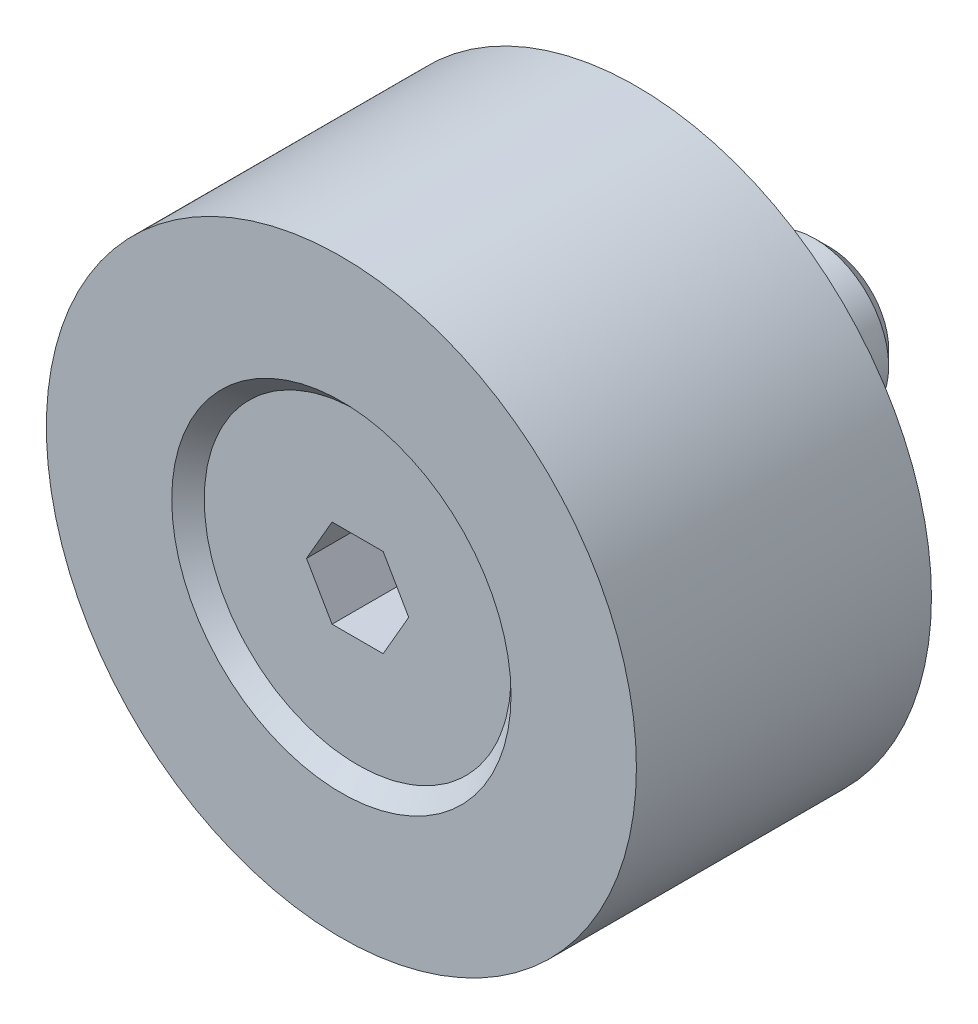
ISO-10303-21;
HEADER;
FILE_DESCRIPTION(('STEP AP214'),'2;1');
FILE_NAME('part.step','',(''),(''),'','','');
FILE_SCHEMA(('AUTOMOTIVE_DESIGN { 1 0 10303 214 1 1 1 1 }'));
ENDSEC;
DATA;
#1=APPLICATION_CONTEXT('core data for automotive mechanical design processes');
#2=APPLICATION_PROTOCOL_DEFINITION('international standard','automotive_design',2000,#1);
#3=PRODUCT_CONTEXT('',#1,'mechanical');
#4=PRODUCT('Part','Part','',(#3));
#5=PRODUCT_RELATED_PRODUCT_CATEGORY('part','',(#4));
#6=PRODUCT_DEFINITION_FORMATION('','',#4);
#7=PRODUCT_DEFINITION_CONTEXT('part definition',#1,'design');
#8=PRODUCT_DEFINITION('design','',#6,#7);
#9=PRODUCT_DEFINITION_SHAPE('','',#8);
#10=(LENGTH_UNIT() NAMED_UNIT(*) SI_UNIT(.MILLI.,.METRE.));
#11=(NAMED_UNIT(*) PLANE_ANGLE_UNIT() SI_UNIT($,.RADIAN.));
#12=(NAMED_UNIT(*) SI_UNIT($,.STERADIAN.) SOLID_ANGLE_UNIT());
#13=UNCERTAINTY_MEASURE_WITH_UNIT(LENGTH_MEASURE(1.E-05),#10,'distance_accuracy_value','');
#14=(GEOMETRIC_REPRESENTATION_CONTEXT(3) GLOBAL_UNCERTAINTY_ASSIGNED_CONTEXT((#13)) GLOBAL_UNIT_ASSIGNED_CONTEXT((#10,
#11,#12)) REPRESENTATION_CONTEXT('',''));
#15=CARTESIAN_POINT('',(0.,0.,0.));
#16=DIRECTION('',(0.,0.,1.));
#17=DIRECTION('',(1.,0.,0.));
#18=AXIS2_PLACEMENT_3D('',#15,#16,#17);
#19=CARTESIAN_POINT('',(0.,0.,3.5));
#20=DIRECTION('',(0.,0.,1.));
#21=DIRECTION('',(1.,0.,0.));
#22=AXIS2_PLACEMENT_3D('',#19,#20,#21);
#23=CYLINDRICAL_SURFACE('',#22,2.75);
#24=CARTESIAN_POINT('',(0.,0.,0.));
#25=DIRECTION('',(0.,0.,1.));
#26=DIRECTION('',(1.,0.,0.));
#27=AXIS2_PLACEMENT_3D('',#24,#25,#26);
#28=CIRCLE('',#27,2.75);
#29=CARTESIAN_POINT('',(2.75,0.,0.));
#30=VERTEX_POINT('',#29);
#31=EDGE_CURVE('P0_E37',#30,#30,#28,.T.);
#32=ORIENTED_EDGE('',*,*,#31,.F.);
#33=CARTESIAN_POINT('',(2.75,0.,1.33514124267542E-06));
#34=CARTESIAN_POINT('',(2.75,0.,6.99999973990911));
#35=B_SPLINE_CURVE_WITH_KNOTS('',1,(#33,#34),.UNSPECIFIED.,.F.,.F.,(2,2),(0.0833334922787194,
0.916666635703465),.UNSPECIFIED.);
#36=CARTESIAN_POINT('',(2.75,0.,7.));
#37=VERTEX_POINT('',#36);
#38=EDGE_CURVE('P0_E25',#30,#37,#35,.T.);
#39=ORIENTED_EDGE('',*,*,#38,.T.);
#40=CARTESIAN_POINT('',(0.,0.,7.));
#41=DIRECTION('',(0.,0.,1.));
#42=DIRECTION('',(1.,0.,0.));
#43=AXIS2_PLACEMENT_3D('',#40,#41,#42);
#44=CIRCLE('',#43,2.75);
#45=EDGE_CURVE('P0_E11',#37,#37,#44,.T.);
#46=ORIENTED_EDGE('',*,*,#45,.T.);
#47=ORIENTED_EDGE('',*,*,#38,.F.);
#48=EDGE_LOOP('',(#32,#39,#46,#47));
#49=FACE_BOUND('',#48,.T.);
#50=ADVANCED_FACE('P0_F16',(#49),#23,.F.);
#51=CARTESIAN_POINT('',(0.,0.,4.25));
#52=DIRECTION('',(0.,0.,1.));
#53=DIRECTION('',(1.,0.,0.));
#54=AXIS2_PLACEMENT_3D('',#51,#52,#53);
#55=CONICAL_SURFACE('',#54,0.,0.785398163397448);
#56=CARTESIAN_POINT('',(0.,0.,10.));
#57=DIRECTION('',(0.,0.,-1.));
#58=DIRECTION('',(1.,0.,0.));
#59=AXIS2_PLACEMENT_3D('',#56,#57,#58);
#60=CIRCLE('',#59,5.75);
#61=CARTESIAN_POINT('',(5.75,0.,10.));
#62=VERTEX_POINT('',#61);
#63=EDGE_CURVE('P0_E76',#62,#62,#60,.T.);
#64=ORIENTED_EDGE('',*,*,#63,.F.);
#65=CARTESIAN_POINT('',(5.75000310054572,0.,10.0000031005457));
#66=CARTESIAN_POINT('',(2.74999945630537,0.,6.99999945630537));
#67=B_SPLINE_CURVE_WITH_KNOTS('',1,(#65,#66),.UNSPECIFIED.,.F.,.F.,(2,2),(0.292892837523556,
0.661818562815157),.UNSPECIFIED.);
#68=EDGE_CURVE('P0_E62',#62,#37,#67,.T.);
#69=ORIENTED_EDGE('',*,*,#68,.T.);
#70=ORIENTED_EDGE('',*,*,#45,.F.);
#71=ORIENTED_EDGE('',*,*,#68,.F.);
#72=EDGE_LOOP('',(#64,#69,#70,#71));
#73=FACE_BOUND('',#72,.T.);
#74=ADVANCED_FACE('P0_F110',(#73),#55,.F.);
#75=CARTESIAN_POINT('',(0.,0.,5.));
#76=DIRECTION('',(0.,0.,1.));
#77=DIRECTION('',(1.,0.,0.));
#78=AXIS2_PLACEMENT_3D('',#75,#76,#77);
#79=CYLINDRICAL_SURFACE('',#78,10.);
#80=CARTESIAN_POINT('',(0.,0.,0.));
#81=DIRECTION('',(0.,0.,-1.));
#82=DIRECTION('',(1.,0.,0.));
#83=AXIS2_PLACEMENT_3D('',#80,#81,#82);
#84=CIRCLE('',#83,10.);
#85=CARTESIAN_POINT('',(10.,0.,0.));
#86=VERTEX_POINT('',#85);
#87=EDGE_CURVE('P0_E55',#86,#86,#84,.T.);
#88=ORIENTED_EDGE('',*,*,#87,.F.);
#89=CARTESIAN_POINT('',(10.,0.,-1.52588690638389E-06));
#90=CARTESIAN_POINT('',(10.,0.,9.99999871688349));
#91=B_SPLINE_CURVE_WITH_KNOTS('',1,(#89,#90),.UNSPECIFIED.,.F.,.F.,(2,2),(0.0833332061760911,
0.916666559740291),.UNSPECIFIED.);
#92=CARTESIAN_POINT('',(10.,0.,10.));
#93=VERTEX_POINT('',#92);
#94=EDGE_CURVE('P0_E52',#86,#93,#91,.T.);
#95=ORIENTED_EDGE('',*,*,#94,.T.);
#96=CARTESIAN_POINT('',(0.,0.,10.));
#97=DIRECTION('',(0.,0.,1.));
#98=DIRECTION('',(1.,0.,0.));
#99=AXIS2_PLACEMENT_3D('',#96,#97,#98);
#100=CIRCLE('',#99,10.);
#101=EDGE_CURVE('P0_E50',#93,#93,#100,.T.);
#102=ORIENTED_EDGE('',*,*,#101,.F.);
#103=ORIENTED_EDGE('',*,*,#94,.F.);
#104=EDGE_LOOP('',(#88,#95,#102,#103));
#105=FACE_BOUND('',#104,.T.);
#106=ADVANCED_FACE('P0_F51',(#105),#79,.T.);
#107=CARTESIAN_POINT('',(13.,-20.7846096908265,0.));
#108=DIRECTION('',(0.,0.,-1.));
#109=DIRECTION('',(-1.,0.,0.));
#110=AXIS2_PLACEMENT_3D('',#107,#108,#109);
#111=PLANE('',#110);
#112=ORIENTED_EDGE('',*,*,#87,.T.);
#113=EDGE_LOOP('',(#112));
#114=FACE_BOUND('',#113,.T.);
#115=ORIENTED_EDGE('',*,*,#31,.T.);
#116=EDGE_LOOP('',(#115));
#117=FACE_BOUND('',#116,.T.);
#118=ADVANCED_FACE('P0_F114',(#114,#117),#111,.T.);
#119=CARTESIAN_POINT('',(-23.,-20.7846096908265,10.));
#120=DIRECTION('',(0.,0.,1.));
#121=DIRECTION('',(1.,0.,0.));
#122=AXIS2_PLACEMENT_3D('',#119,#120,#121);
#123=PLANE('',#122);
#124=ORIENTED_EDGE('',*,*,#101,.T.);
#125=EDGE_LOOP('',(#124));
#126=FACE_BOUND('',#125,.T.);
#127=ORIENTED_EDGE('',*,*,#63,.T.);
#128=EDGE_LOOP('',(#127));
#129=FACE_BOUND('',#128,.T.);
#130=ADVANCED_FACE('P0_F112',(#126,#129),#123,.T.);
#131=CLOSED_SHELL('',(#50,#74,#106,#118,#130));
#132=MANIFOLD_SOLID_BREP('P0_B1',#131);
#133=CARTESIAN_POINT('',(0.,0.,-5.01446609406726));
#134=DIRECTION('',(0.,0.,1.));
#135=DIRECTION('',(1.,0.,0.));
#136=AXIS2_PLACEMENT_3D('',#133,#134,#135);
#137=CONICAL_SURFACE('',#136,3.53553390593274,0.785398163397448);
#138=CARTESIAN_POINT('',(0.,0.,-6.55));
#139=DIRECTION('',(0.,0.,1.));
#140=DIRECTION('',(-1.,0.,0.));
#141=AXIS2_PLACEMENT_3D('',#138,#139,#140);
#142=CIRCLE('',#141,2.);
#143=CARTESIAN_POINT('',(-2.,0.,-6.55));
#144=VERTEX_POINT('',#143);
#145=CARTESIAN_POINT('',(2.,0.,-6.55));
#146=VERTEX_POINT('',#145);
#147=EDGE_CURVE('P1_E39',#144,#146,#142,.T.);
#148=ORIENTED_EDGE('',*,*,#147,.T.);
#149=CARTESIAN_POINT('',(1.99999946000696,0.,-6.55000053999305));
#150=CARTESIAN_POINT('',(2.49999825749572,0.,-6.05000174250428));
#151=B_SPLINE_CURVE_WITH_KNOTS('',1,(#149,#150),.UNSPECIFIED.,.F.,.F.,(2,2),(0.56568527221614,
0.707106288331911),.UNSPECIFIED.);
#152=CARTESIAN_POINT('',(2.5,0.,-6.05));
#153=VERTEX_POINT('',#152);
#154=EDGE_CURVE('P1_E24',#146,#153,#151,.T.);
#155=ORIENTED_EDGE('',*,*,#154,.T.);
#156=CARTESIAN_POINT('',(0.,0.,-6.05));
#157=DIRECTION('',(0.,0.,-1.));
#158=DIRECTION('',(-1.,0.,0.));
#159=AXIS2_PLACEMENT_3D('',#156,#157,#158);
#160=CIRCLE('',#159,2.5);
#161=CARTESIAN_POINT('',(-2.5,0.,-6.05));
#162=VERTEX_POINT('',#161);
#163=EDGE_CURVE('P1_E111',#153,#162,#160,.T.);
#164=ORIENTED_EDGE('',*,*,#163,.T.);
#165=CARTESIAN_POINT('',(0.,0.,-6.05));
#166=DIRECTION('',(0.,0.,-1.));
#167=DIRECTION('',(-1.,0.,0.));
#168=AXIS2_PLACEMENT_3D('',#165,#166,#167);
#169=CIRCLE('',#168,2.5);
#170=EDGE_CURVE('P1_E10',#162,#153,#169,.T.);
#171=ORIENTED_EDGE('',*,*,#170,.T.);
#172=ORIENTED_EDGE('',*,*,#154,.F.);
#173=CARTESIAN_POINT('',(0.,0.,-6.55));
#174=DIRECTION('',(0.,0.,1.));
#175=DIRECTION('',(-1.,0.,0.));
#176=AXIS2_PLACEMENT_3D('',#173,#174,#175);
#177=CIRCLE('',#176,2.);
#178=EDGE_CURVE('P1_E106',#146,#144,#177,.T.);
#179=ORIENTED_EDGE('',*,*,#178,.T.);
#180=EDGE_LOOP('',(#148,#155,#164,#171,#172,#179));
#181=FACE_BOUND('',#180,.T.);
#182=ADVANCED_FACE('P1_F15',(#181),#137,.T.);
#183=CARTESIAN_POINT('',(0.,0.,1.45));
#184=DIRECTION('',(0.,0.,-1.));
#185=DIRECTION('',(-1.,0.,0.));
#186=AXIS2_PLACEMENT_3D('',#183,#184,#185);
#187=CYLINDRICAL_SURFACE('',#186,2.5);
#188=CARTESIAN_POINT('',(0.,0.,6.75));
#189=DIRECTION('',(0.,0.,1.));
#190=DIRECTION('',(1.,0.,0.));
#191=AXIS2_PLACEMENT_3D('',#188,#189,#190);
#192=CIRCLE('',#191,2.5);
#193=CARTESIAN_POINT('',(-2.5,0.,6.75));
#194=VERTEX_POINT('',#193);
#195=CARTESIAN_POINT('',(2.5,0.,6.75));
#196=VERTEX_POINT('',#195);
#197=EDGE_CURVE('P1_E97',#194,#196,#192,.T.);
#198=ORIENTED_EDGE('',*,*,#197,.F.);
#199=CARTESIAN_POINT('',(-2.5,0.,6.74999902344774));
#200=CARTESIAN_POINT('',(-2.5,0.,-6.05000130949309));
#201=B_SPLINE_CURVE_WITH_KNOTS('',1,(#199,#200),.UNSPECIFIED.,.F.,.F.,(2,2),(0.0833333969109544,
0.916666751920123),.UNSPECIFIED.);
#202=EDGE_CURVE('P1_E32',#194,#162,#201,.T.);
#203=ORIENTED_EDGE('',*,*,#202,.T.);
#204=ORIENTED_EDGE('',*,*,#163,.F.);
#205=ORIENTED_EDGE('',*,*,#170,.F.);
#206=ORIENTED_EDGE('',*,*,#202,.F.);
#207=CARTESIAN_POINT('',(0.,0.,6.75));
#208=DIRECTION('',(0.,0.,1.));
#209=DIRECTION('',(1.,0.,0.));
#210=AXIS2_PLACEMENT_3D('',#207,#208,#209);
#211=CIRCLE('',#210,2.5);
#212=EDGE_CURVE('P1_E93',#196,#194,#211,.T.);
#213=ORIENTED_EDGE('',*,*,#212,.F.);
#214=EDGE_LOOP('',(#198,#203,#204,#205,#206,#213));
#215=FACE_BOUND('',#214,.T.);
#216=ADVANCED_FACE('P1_F100',(#215),#187,.T.);
#217=CARTESIAN_POINT('',(4.6,-4.1569219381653,-6.55));
#218=DIRECTION('',(0.,0.,-1.));
#219=DIRECTION('',(-1.,0.,0.));
#220=AXIS2_PLACEMENT_3D('',#217,#218,#219);
#221=PLANE('',#220);
#222=ORIENTED_EDGE('',*,*,#178,.F.);
#223=ORIENTED_EDGE('',*,*,#147,.F.);
#224=EDGE_LOOP('',(#222,#223));
#225=FACE_BOUND('',#224,.T.);
#226=ADVANCED_FACE('P1_F264',(#225),#221,.T.);
#227=CARTESIAN_POINT('',(-1.03923048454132,1.5,9.7));
#228=DIRECTION('',(0.,1.,0.));
#229=DIRECTION('',(1.,0.,0.));
#230=AXIS2_PLACEMENT_3D('',#227,#228,#229);
#231=PLANE('',#230);
#232=DIRECTION('',(-1.,0.,0.));
#233=VECTOR('',#232,1.);
#234=CARTESIAN_POINT('',(0.866025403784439,1.5,6.95));
#235=LINE('',#234,#233);
#236=CARTESIAN_POINT('',(0.866025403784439,1.5,6.95));
#237=VERTEX_POINT('',#236);
#238=CARTESIAN_POINT('',(-0.866025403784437,1.5,6.95));
#239=VERTEX_POINT('',#238);
#240=EDGE_CURVE('P1_E103',#237,#239,#235,.T.);
#241=ORIENTED_EDGE('',*,*,#240,.F.);
#242=DIRECTION('',(0.,0.,-1.));
#243=VECTOR('',#242,1.);
#244=CARTESIAN_POINT('',(0.866025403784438,1.5,9.45));
#245=LINE('',#244,#243);
#246=CARTESIAN_POINT('',(0.866025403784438,1.5,9.45));
#247=VERTEX_POINT('',#246);
#248=EDGE_CURVE('P1_E247',#247,#237,#245,.T.);
#249=ORIENTED_EDGE('',*,*,#248,.F.);
#250=DIRECTION('',(1.,0.,0.));
#251=VECTOR('',#250,1.);
#252=CARTESIAN_POINT('',(-0.866025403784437,1.5,9.45));
#253=LINE('',#252,#251);
#254=CARTESIAN_POINT('',(-0.866025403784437,1.5,9.45));
#255=VERTEX_POINT('',#254);
#256=EDGE_CURVE('P1_E241',#255,#247,#253,.T.);
#257=ORIENTED_EDGE('',*,*,#256,.F.);
#258=DIRECTION('',(0.,0.,-1.));
#259=VECTOR('',#258,1.);
#260=CARTESIAN_POINT('',(-0.866025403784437,1.5,9.45));
#261=LINE('',#260,#259);
#262=EDGE_CURVE('P1_E236',#255,#239,#261,.T.);
#263=ORIENTED_EDGE('',*,*,#262,.T.);
#264=EDGE_LOOP('',(#241,#249,#257,#263));
#265=FACE_BOUND('',#264,.T.);
#266=ADVANCED_FACE('P1_F266',(#265),#231,.F.);
#267=CARTESIAN_POINT('',(-1.81865334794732,-0.149999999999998,9.7));
#268=DIRECTION('',(-0.866025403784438,0.500000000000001,0.));
#269=DIRECTION('',(0.500000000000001,0.866025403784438,0.));
#270=AXIS2_PLACEMENT_3D('',#267,#268,#269);
#271=PLANE('',#270);
#272=DIRECTION('',(-0.500000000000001,-0.866025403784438,0.));
#273=VECTOR('',#272,1.);
#274=CARTESIAN_POINT('',(-0.866025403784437,1.5,6.95));
#275=LINE('',#274,#273);
#276=CARTESIAN_POINT('',(-1.73205080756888,0.,6.95));
#277=VERTEX_POINT('',#276);
#278=EDGE_CURVE('P1_E230',#239,#277,#275,.T.);
#279=ORIENTED_EDGE('',*,*,#278,.F.);
#280=ORIENTED_EDGE('',*,*,#262,.F.);
#281=DIRECTION('',(0.500000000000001,0.866025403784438,0.));
#282=VECTOR('',#281,1.);
#283=CARTESIAN_POINT('',(-1.73205080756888,0.,9.45));
#284=LINE('',#283,#282);
#285=CARTESIAN_POINT('',(-1.73205080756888,0.,9.45));
#286=VERTEX_POINT('',#285);
#287=EDGE_CURVE('P1_E224',#286,#255,#284,.T.);
#288=ORIENTED_EDGE('',*,*,#287,.F.);
#289=DIRECTION('',(0.,0.,-1.));
#290=VECTOR('',#289,1.);
#291=CARTESIAN_POINT('',(-1.73205080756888,0.,9.45));
#292=LINE('',#291,#290);
#293=EDGE_CURVE('P1_E219',#286,#277,#292,.T.);
#294=ORIENTED_EDGE('',*,*,#293,.T.);
#295=EDGE_LOOP('',(#279,#280,#288,#294));
#296=FACE_BOUND('',#295,.T.);
#297=ADVANCED_FACE('P1_F273',(#296),#271,.F.);
#298=CARTESIAN_POINT('',(-0.779422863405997,-1.65,9.7));
#299=DIRECTION('',(-0.866025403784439,-0.499999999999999,0.));
#300=DIRECTION('',(-0.499999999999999,0.866025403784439,0.));
#301=AXIS2_PLACEMENT_3D('',#298,#299,#300);
#302=PLANE('',#301);
#303=DIRECTION('',(0.499999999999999,-0.866025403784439,0.));
#304=VECTOR('',#303,1.);
#305=CARTESIAN_POINT('',(-1.73205080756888,0.,6.95));
#306=LINE('',#305,#304);
#307=CARTESIAN_POINT('',(-0.866025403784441,-1.5,6.95));
#308=VERTEX_POINT('',#307);
#309=EDGE_CURVE('P1_E213',#277,#308,#306,.T.);
#310=ORIENTED_EDGE('',*,*,#309,.F.);
#311=ORIENTED_EDGE('',*,*,#293,.F.);
#312=DIRECTION('',(-0.499999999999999,0.866025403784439,0.));
#313=VECTOR('',#312,1.);
#314=CARTESIAN_POINT('',(-0.866025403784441,-1.5,9.45));
#315=LINE('',#314,#313);
#316=CARTESIAN_POINT('',(-0.866025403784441,-1.5,9.45));
#317=VERTEX_POINT('',#316);
#318=EDGE_CURVE('P1_E207',#317,#286,#315,.T.);
#319=ORIENTED_EDGE('',*,*,#318,.F.);
#320=DIRECTION('',(0.,0.,-1.));
#321=VECTOR('',#320,1.);
#322=CARTESIAN_POINT('',(-0.866025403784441,-1.5,9.45));
#323=LINE('',#322,#321);
#324=EDGE_CURVE('P1_E202',#317,#308,#323,.T.);
#325=ORIENTED_EDGE('',*,*,#324,.T.);
#326=EDGE_LOOP('',(#310,#311,#319,#325));
#327=FACE_BOUND('',#326,.T.);
#328=ADVANCED_FACE('P1_F309',(#327),#302,.F.);
#329=CARTESIAN_POINT('',(1.03923048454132,-1.5,9.7));
#330=DIRECTION('',(0.,-1.,0.));
#331=DIRECTION('',(-1.,0.,0.));
#332=AXIS2_PLACEMENT_3D('',#329,#330,#331);
#333=PLANE('',#332);
#334=DIRECTION('',(1.,0.,0.));
#335=VECTOR('',#334,1.);
#336=CARTESIAN_POINT('',(-0.866025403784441,-1.5,6.95));
#337=LINE('',#336,#335);
#338=CARTESIAN_POINT('',(0.866025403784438,-1.5,6.95));
#339=VERTEX_POINT('',#338);
#340=EDGE_CURVE('P1_E196',#308,#339,#337,.T.);
#341=ORIENTED_EDGE('',*,*,#340,.F.);
#342=ORIENTED_EDGE('',*,*,#324,.F.);
#343=DIRECTION('',(-1.,0.,0.));
#344=VECTOR('',#343,1.);
#345=CARTESIAN_POINT('',(0.866025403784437,-1.5,9.45));
#346=LINE('',#345,#344);
#347=CARTESIAN_POINT('',(0.866025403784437,-1.5,9.45));
#348=VERTEX_POINT('',#347);
#349=EDGE_CURVE('P1_E190',#348,#317,#346,.T.);
#350=ORIENTED_EDGE('',*,*,#349,.F.);
#351=DIRECTION('',(0.,0.,-1.));
#352=VECTOR('',#351,1.);
#353=CARTESIAN_POINT('',(0.866025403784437,-1.5,9.45));
#354=LINE('',#353,#352);
#355=EDGE_CURVE('P1_E185',#348,#339,#354,.T.);
#356=ORIENTED_EDGE('',*,*,#355,.T.);
#357=EDGE_LOOP('',(#341,#342,#350,#356));
#358=FACE_BOUND('',#357,.T.);
#359=ADVANCED_FACE('P1_F317',(#358),#333,.F.);
#360=CARTESIAN_POINT('',(1.81865334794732,0.15,9.7));
#361=DIRECTION('',(0.866025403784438,-0.500000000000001,0.));
#362=DIRECTION('',(-0.500000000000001,-0.866025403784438,0.));
#363=AXIS2_PLACEMENT_3D('',#360,#361,#362);
#364=PLANE('',#363);
#365=DIRECTION('',(0.5,0.866025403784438,0.));
#366=VECTOR('',#365,1.);
#367=CARTESIAN_POINT('',(0.866025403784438,-1.5,6.95));
#368=LINE('',#367,#366);
#369=CARTESIAN_POINT('',(1.73205080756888,0.,6.95));
#370=VERTEX_POINT('',#369);
#371=EDGE_CURVE('P1_E179',#339,#370,#368,.T.);
#372=ORIENTED_EDGE('',*,*,#371,.F.);
#373=ORIENTED_EDGE('',*,*,#355,.F.);
#374=DIRECTION('',(-0.500000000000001,-0.866025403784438,0.));
#375=VECTOR('',#374,1.);
#376=CARTESIAN_POINT('',(1.73205080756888,0.,9.45));
#377=LINE('',#376,#375);
#378=CARTESIAN_POINT('',(1.73205080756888,0.,9.45));
#379=VERTEX_POINT('',#378);
#380=EDGE_CURVE('P1_E173',#379,#348,#377,.T.);
#381=ORIENTED_EDGE('',*,*,#380,.F.);
#382=DIRECTION('',(0.,0.,-1.));
#383=VECTOR('',#382,1.);
#384=CARTESIAN_POINT('',(1.73205080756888,0.,9.45));
#385=LINE('',#384,#383);
#386=EDGE_CURVE('P1_E168',#379,#370,#385,.T.);
#387=ORIENTED_EDGE('',*,*,#386,.T.);
#388=EDGE_LOOP('',(#372,#373,#381,#387));
#389=FACE_BOUND('',#388,.T.);
#390=ADVANCED_FACE('P1_F326',(#389),#364,.F.);
#391=CARTESIAN_POINT('',(0.779422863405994,1.65,9.7));
#392=DIRECTION('',(0.866025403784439,0.5,0.));
#393=DIRECTION('',(0.5,-0.866025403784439,0.));
#394=AXIS2_PLACEMENT_3D('',#391,#392,#393);
#395=PLANE('',#394);
#396=DIRECTION('',(-0.5,0.866025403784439,0.));
#397=VECTOR('',#396,1.);
#398=CARTESIAN_POINT('',(1.73205080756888,0.,6.95));
#399=LINE('',#398,#397);
#400=EDGE_CURVE('P1_E162',#370,#237,#399,.T.);
#401=ORIENTED_EDGE('',*,*,#400,.F.);
#402=ORIENTED_EDGE('',*,*,#386,.F.);
#403=DIRECTION('',(0.5,-0.866025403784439,0.));
#404=VECTOR('',#403,1.);
#405=CARTESIAN_POINT('',(0.866025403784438,1.5,9.45));
#406=LINE('',#405,#404);
#407=EDGE_CURVE('P1_E117',#247,#379,#406,.T.);
#408=ORIENTED_EDGE('',*,*,#407,.F.);
#409=ORIENTED_EDGE('',*,*,#248,.T.);
#410=EDGE_LOOP('',(#401,#402,#408,#409));
#411=FACE_BOUND('',#410,.T.);
#412=ADVANCED_FACE('P1_F335',(#411),#395,.F.);
#413=CARTESIAN_POINT('',(2.07846096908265,-1.8,6.95));
#414=DIRECTION('',(0.,0.,-1.));
#415=DIRECTION('',(-1.,0.,0.));
#416=AXIS2_PLACEMENT_3D('',#413,#414,#415);
#417=PLANE('',#416);
#418=ORIENTED_EDGE('',*,*,#240,.T.);
#419=ORIENTED_EDGE('',*,*,#278,.T.);
#420=ORIENTED_EDGE('',*,*,#309,.T.);
#421=ORIENTED_EDGE('',*,*,#340,.T.);
#422=ORIENTED_EDGE('',*,*,#371,.T.);
#423=ORIENTED_EDGE('',*,*,#400,.T.);
#424=EDGE_LOOP('',(#418,#419,#420,#421,#422,#423));
#425=FACE_BOUND('',#424,.T.);
#426=ADVANCED_FACE('P1_F344',(#425),#417,.F.);
#427=CARTESIAN_POINT('',(0.,0.,9.45));
#428=DIRECTION('',(0.,0.,1.));
#429=DIRECTION('',(-1.,0.,0.));
#430=AXIS2_PLACEMENT_3D('',#427,#428,#429);
#431=CONICAL_SURFACE('',#430,5.2,0.785398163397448);
#432=ORIENTED_EDGE('',*,*,#212,.T.);
#433=CARTESIAN_POINT('',(-2.5,0.,6.75));
#434=CARTESIAN_POINT('',(-5.2,0.,9.45));
#435=B_SPLINE_CURVE_WITH_KNOTS('',1,(#433,#434),.UNSPECIFIED.,.F.,.F.,(2,2),(0.,1.),.UNSPECIFIED.);
#436=CARTESIAN_POINT('',(-5.2,0.,9.45));
#437=VERTEX_POINT('',#436);
#438=EDGE_CURVE('P1_E96',#194,#437,#435,.T.);
#439=ORIENTED_EDGE('',*,*,#438,.T.);
#440=CARTESIAN_POINT('',(0.,0.,9.45));
#441=DIRECTION('',(0.,0.,1.));
#442=DIRECTION('',(-1.,0.,0.));
#443=AXIS2_PLACEMENT_3D('',#440,#441,#442);
#444=CIRCLE('',#443,5.2);
#445=EDGE_CURVE('P1_E109',#437,#437,#444,.T.);
#446=ORIENTED_EDGE('',*,*,#445,.F.);
#447=ORIENTED_EDGE('',*,*,#438,.F.);
#448=ORIENTED_EDGE('',*,*,#197,.T.);
#449=EDGE_LOOP('',(#432,#439,#446,#447,#448));
#450=FACE_BOUND('',#449,.T.);
#451=ADVANCED_FACE('P1_F94',(#450),#431,.T.);
#452=CARTESIAN_POINT('',(-6.76,-10.8079970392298,9.45));
#453=DIRECTION('',(0.,0.,1.));
#454=DIRECTION('',(1.,0.,0.));
#455=AXIS2_PLACEMENT_3D('',#452,#453,#454);
#456=PLANE('',#455);
#457=ORIENTED_EDGE('',*,*,#445,.T.);
#458=EDGE_LOOP('',(#457));
#459=FACE_BOUND('',#458,.T.);
#460=ORIENTED_EDGE('',*,*,#256,.T.);
#461=ORIENTED_EDGE('',*,*,#407,.T.);
#462=ORIENTED_EDGE('',*,*,#380,.T.);
#463=ORIENTED_EDGE('',*,*,#349,.T.);
#464=ORIENTED_EDGE('',*,*,#318,.T.);
#465=ORIENTED_EDGE('',*,*,#287,.T.);
#466=EDGE_LOOP('',(#460,#461,#462,#463,#464,#465));
#467=FACE_BOUND('',#466,.T.);
#468=ADVANCED_FACE('P1_F361',(#459,#467),#456,.T.);
#469=CLOSED_SHELL('',(#182,#216,#226,#266,#297,#328,#359,#390,#412,#426,#451,#468));
#470=MANIFOLD_SOLID_BREP('P1_B1',#469);
#471=ADVANCED_BREP_SHAPE_REPRESENTATION('',(#18,#132,#470),#14);
#472=SHAPE_DEFINITION_REPRESENTATION(#9,#471);
ENDSEC;
END-ISO-10303-21;
